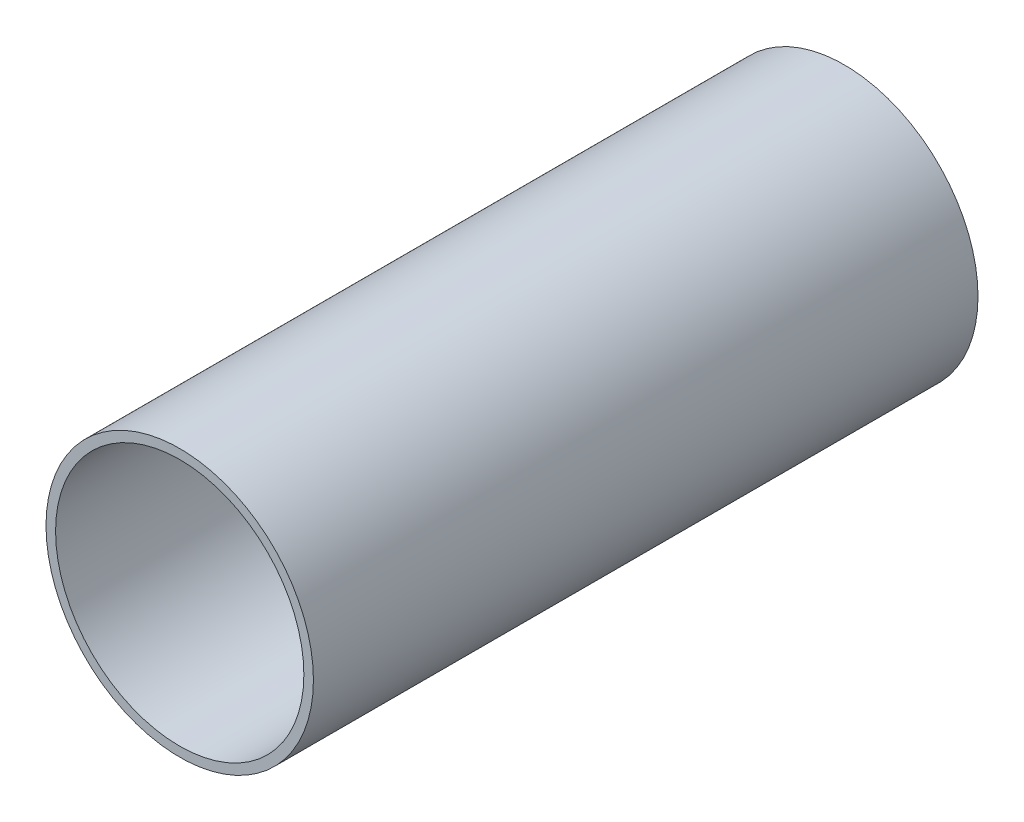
from build123d import *

# Parameters (mm, degrees)
ESQUISSE1_R      = 50.3
ESQUISSE1_R_2    = 46.7
EXTRUSION1_DEPTH = 250


with BuildPart() as part:
    # Esquisse1 → Extrusion1 (new body)
    with BuildSketch(Plane.XY):
        Circle(ESQUISSE1_R)
        Circle(ESQUISSE1_R_2, mode=Mode.SUBTRACT)
    extrude(amount=EXTRUSION1_DEPTH)


solid = part.part
